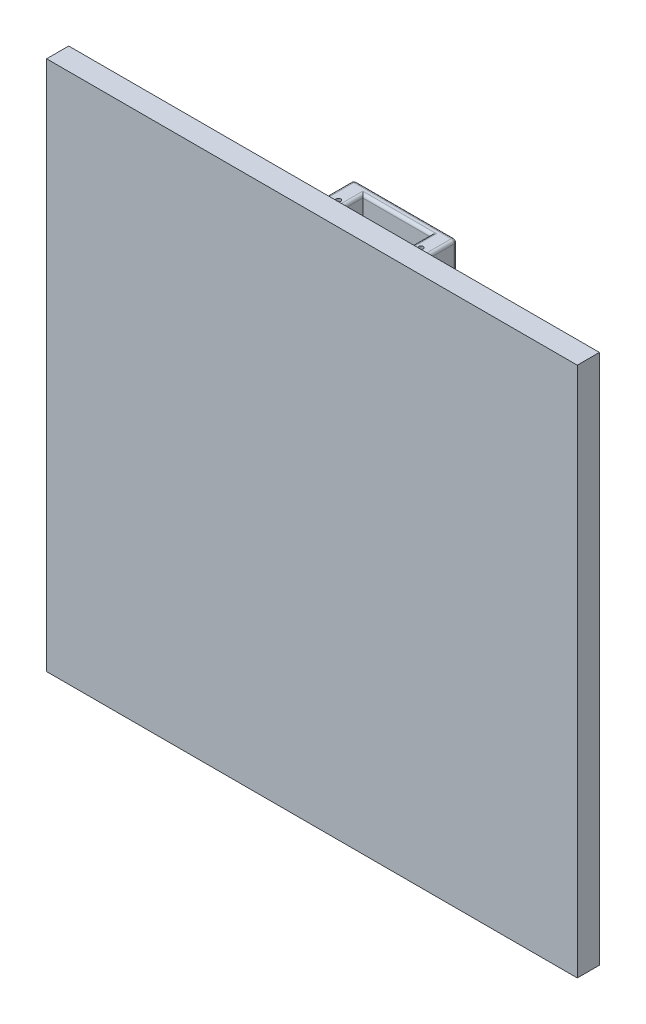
from build123d import *
from build123d.topology import SkipClean

# Parameters (mm, degrees)
SKIZZE1_W                       = 180
SKIZZE1_H                       = 180
AUFSATZ_LINEAR_AUSTRAGEN1_DEPTH = 7.5
SKIZZE2_R                       = 25
AUFSATZ_LINEAR_AUSTRAGEN2_DEPTH = 50
SCHNITT_ROTATION23_ANGLE        = 180
VERRUNDUNG1_R                   = 2.5
VERRUNDUNG2_R                   = 2.5
SKIZZE10_W                      = 35
SKIZZE10_H                      = 10
AUFSATZ_LINEAR_AUSTRAGEN4_DEPTH = 24.25
SKIZZE12_W                      = 23
SKIZZE12_H                      = 12.5
SCHNITT_LINEAR_AUSTRAGEN1_DEPTH = 12.5
VERRUNDUNG3_R                   = 1
SKIZZE13_R                      = 0.75
SCHNITT_LINEAR_AUSTRAGEN2_DEPTH = 7.5
SKIZZE14_W                      = 10
SKIZZE14_H                      = 55
AUFSATZ_LINEAR_AUSTRAGEN5_DEPTH = 35
SKIZZE15_W                      = 19.5
SKIZZE15_H                      = 40.5
SCHNITT_LINEAR_AUSTRAGEN3_DEPTH = 24.25
VERRUNDUNG4_R                   = 1
SKIZZE16_R                      = 0.75
SCHNITT_LINEAR_AUSTRAGEN4_DEPTH = 7.5


with BuildPart() as part:
    # Skizze1 → Aufsatz-Linear austragen1 (new body)
    with BuildSketch(Plane.XY):
        with Locations((90, 90)):
            Rectangle(SKIZZE1_W, SKIZZE1_H)
    extrude(amount=AUFSATZ_LINEAR_AUSTRAGEN1_DEPTH)

    # Skizze2 → Aufsatz-Linear austragen2 (add)
    with BuildSketch(Plane(origin=(0, 0, 0), x_dir=(-1, 0, 0), z_dir=(0, 0, -1))):
        with Locations((-90, 90)):
            Circle(SKIZZE2_R)
    extrude(amount=AUFSATZ_LINEAR_AUSTRAGEN2_DEPTH)

    # Skizze7 → Schnitt-Rotation23 (revolve, cut)
    with SkipClean():  # the faces are left unmerged after this step: merging them gives an invalid solid
        with BuildSketch(Plane(origin=(0, 0, -50), x_dir=(-1, 0, 0), z_dir=(0, 0, -1))):
            with BuildLine():
                ThreePointArc((-70, 90), (-90, 110), (-110, 90))
                Line((-110, 90), (-70, 90))
            make_face()
            with BuildLine():
                Line((-70, 90), (-110, 90))
                ThreePointArc((-110, 90), (-90, 70), (-70, 90))
            make_face()
        revolve(axis=Axis((115, 90, -50), (-1, 0, 0)), revolution_arc=SCHNITT_ROTATION23_ANGLE, mode=Mode.SUBTRACT)

    # Verrundung1
    verrundung1_edges = [part.edges().sort_by_distance(p)[0] for p in [
        (115, 90, -50),
    ]]
    fillet(verrundung1_edges, radius=VERRUNDUNG1_R)

    # Verrundung2
    verrundung2_edges = [part.edges().sort_by_distance(p)[0] for p in [
        (90, 110, -50),
    ]]
    fillet(verrundung2_edges, radius=VERRUNDUNG2_R)

    # Skizze10 → Aufsatz-Linear austragen4 (add)
    with BuildSketch(Plane(origin=(0, 0, 0), x_dir=(-1, 0, 0), z_dir=(0, 0, -1))):
        with Locations((-90, 160)):
            Rectangle(SKIZZE10_W, SKIZZE10_H)
    extrude(amount=AUFSATZ_LINEAR_AUSTRAGEN4_DEPTH)

    # Skizze12 → Schnitt-Linear austragen1 (cut)
    with BuildSketch(Plane(origin=(0, 165, 0), x_dir=(1, 0, 0), z_dir=(0, 1, 0))):
        with Locations((90, 15)):
            Rectangle(SKIZZE12_W, SKIZZE12_H)
    extrude(amount=-SCHNITT_LINEAR_AUSTRAGEN1_DEPTH, mode=Mode.SUBTRACT)

    # Verrundung3
    verrundung3_edges = [part.edges().sort_by_distance(p)[0] for p in [
        (107.5, 160, 0),
        (107.5, 165, -12.125),
        (90, 155, 0),
        (107.5, 155, -12.125),
        (72.5, 160, 0),
        (72.5, 155, -12.125),
        (90, 165, 0),
        (72.5, 165, -12.125),
        (107.5, 160, -24.25),
        (90, 155, -24.25),
        (72.5, 160, -24.25),
        (90, 165, -24.25),
        (90, 165, -21.25),
        (101.5, 155, -15),
        (90, 155, -8.75),
        (78.5, 165, -15),
        (90, 155, -21.25),
        (78.5, 155, -15),
        (90, 165, -8.75),
        (101.5, 165, -15),
    ]]
    fillet(verrundung3_edges, radius=VERRUNDUNG3_R)

    # Skizze13 → Schnitt-Linear austragen2 (cut)
    with BuildSketch(Plane(origin=(0, 165, 0), x_dir=(1, 0, 0), z_dir=(0, 1, 0))):
        with Locations(Location((76, 15.5, 0), (0, 0, 270))):
            Circle(SKIZZE13_R)
        with Locations(Location((104, 15.5, 0), (0, 0, 270))):
            Circle(SKIZZE13_R)
    extrude(amount=-SCHNITT_LINEAR_AUSTRAGEN2_DEPTH, mode=Mode.SUBTRACT)

    # Skizze14 → Aufsatz-Linear austragen5 (add)
    with BuildSketch(Plane(origin=(0, 0, 0), x_dir=(-1, 0, 0), z_dir=(0, 0, -1))):
        with Locations((-20, 90)):
            Rectangle(SKIZZE14_W, SKIZZE14_H)
    extrude(amount=AUFSATZ_LINEAR_AUSTRAGEN5_DEPTH)

    # Skizze15 → Schnitt-Linear austragen3 (cut)
    with BuildSketch(Plane.ZY.offset(-15)):
        with Locations((-20.25, 90)):
            Rectangle(SKIZZE15_W, SKIZZE15_H)
    extrude(amount=-SCHNITT_LINEAR_AUSTRAGEN3_DEPTH, mode=Mode.SUBTRACT)

    # Verrundung4
    verrundung4_edges = [part.edges().sort_by_distance(p)[0] for p in [
        (25, 90, 0),
        (25, 117.5, -17.5),
        (20, 62.5, 0),
        (25, 62.5, -17.5),
        (15, 90, 0),
        (15, 62.5, -17.5),
        (20, 117.5, 0),
        (15, 117.5, -17.5),
        (25, 90, -35),
        (20, 62.5, -35),
        (15, 90, -35),
        (20, 117.5, -35),
        (25, 90, -10.5),
        (25, 69.75, -20.25),
        (25, 90, -30),
        (25, 110.25, -20.25),
        (15, 90, -10.5),
        (15, 110.25, -20.25),
        (15, 90, -30),
        (15, 69.75, -20.25),
    ]]
    fillet(verrundung4_edges, radius=VERRUNDUNG4_R)

    # Skizze16 → Schnitt-Linear austragen4 (cut)
    with BuildSketch(Plane.ZY.offset(-15)):
        with Locations((-15, 76)):
            Circle(SKIZZE16_R)
        with Locations((-15, 104)):
            Circle(SKIZZE16_R)
    extrude(amount=-SCHNITT_LINEAR_AUSTRAGEN4_DEPTH, mode=Mode.SUBTRACT)


solid = part.part
